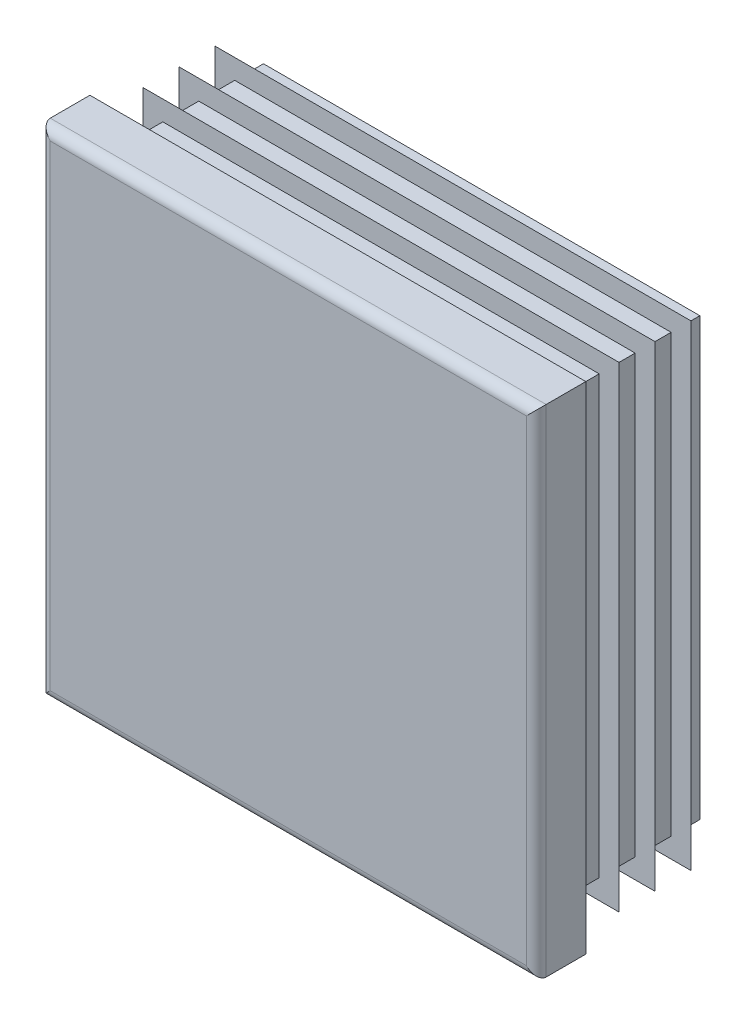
ISO-10303-21;
HEADER;
FILE_DESCRIPTION(('STEP AP214'),'2;1');
FILE_NAME('part.step','',(''),(''),'','','');
FILE_SCHEMA(('AUTOMOTIVE_DESIGN { 1 0 10303 214 1 1 1 1 }'));
ENDSEC;
DATA;
#1=APPLICATION_CONTEXT('core data for automotive mechanical design processes');
#2=APPLICATION_PROTOCOL_DEFINITION('international standard','automotive_design',2000,#1);
#3=PRODUCT_CONTEXT('',#1,'mechanical');
#4=PRODUCT('Part','Part','',(#3));
#5=PRODUCT_RELATED_PRODUCT_CATEGORY('part','',(#4));
#6=PRODUCT_DEFINITION_FORMATION('','',#4);
#7=PRODUCT_DEFINITION_CONTEXT('part definition',#1,'design');
#8=PRODUCT_DEFINITION('design','',#6,#7);
#9=PRODUCT_DEFINITION_SHAPE('','',#8);
#10=(LENGTH_UNIT() NAMED_UNIT(*) SI_UNIT(.MILLI.,.METRE.));
#11=(NAMED_UNIT(*) PLANE_ANGLE_UNIT() SI_UNIT($,.RADIAN.));
#12=(NAMED_UNIT(*) SI_UNIT($,.STERADIAN.) SOLID_ANGLE_UNIT());
#13=UNCERTAINTY_MEASURE_WITH_UNIT(LENGTH_MEASURE(1.E-05),#10,'distance_accuracy_value','');
#14=(GEOMETRIC_REPRESENTATION_CONTEXT(3) GLOBAL_UNCERTAINTY_ASSIGNED_CONTEXT((#13)) GLOBAL_UNIT_ASSIGNED_CONTEXT((#10,
#11,#12)) REPRESENTATION_CONTEXT('',''));
#15=CARTESIAN_POINT('',(0.,0.,0.));
#16=DIRECTION('',(0.,0.,1.));
#17=DIRECTION('',(1.,0.,0.));
#18=AXIS2_PLACEMENT_3D('',#15,#16,#17);
#19=CARTESIAN_POINT('',(24.,-25.,5.));
#20=DIRECTION('',(0.,0.,-1.));
#21=DIRECTION('',(0.,1.,0.));
#22=AXIS2_PLACEMENT_3D('',#19,#20,#21);
#23=PLANE('',#22);
#24=DIRECTION('',(0.,1.,0.));
#25=VECTOR('',#24,1.);
#26=CARTESIAN_POINT('',(-24.,-25.,5.));
#27=LINE('',#26,#25);
#28=CARTESIAN_POINT('',(-24.,-24.,5.));
#29=VERTEX_POINT('',#28);
#30=CARTESIAN_POINT('',(-24.,24.,5.));
#31=VERTEX_POINT('',#30);
#32=EDGE_CURVE('E262',#29,#31,#27,.T.);
#33=ORIENTED_EDGE('',*,*,#32,.F.);
#34=DIRECTION('',(-1.,0.,0.));
#35=VECTOR('',#34,1.);
#36=CARTESIAN_POINT('',(25.,-24.,5.));
#37=LINE('',#36,#35);
#38=CARTESIAN_POINT('',(24.,-24.,5.));
#39=VERTEX_POINT('',#38);
#40=EDGE_CURVE('E432',#39,#29,#37,.T.);
#41=ORIENTED_EDGE('',*,*,#40,.F.);
#42=DIRECTION('',(0.,1.,0.));
#43=VECTOR('',#42,1.);
#44=CARTESIAN_POINT('',(24.,-25.,5.));
#45=LINE('',#44,#43);
#46=CARTESIAN_POINT('',(24.,24.,5.));
#47=VERTEX_POINT('',#46);
#48=EDGE_CURVE('E257',#39,#47,#45,.T.);
#49=ORIENTED_EDGE('',*,*,#48,.T.);
#50=DIRECTION('',(-1.,0.,0.));
#51=VECTOR('',#50,1.);
#52=CARTESIAN_POINT('',(25.,24.,5.));
#53=LINE('',#52,#51);
#54=EDGE_CURVE('E534',#47,#31,#53,.T.);
#55=ORIENTED_EDGE('',*,*,#54,.T.);
#56=EDGE_LOOP('',(#33,#41,#49,#55));
#57=FACE_BOUND('',#56,.T.);
#58=ADVANCED_FACE('F14',(#57),#23,.F.);
#59=CARTESIAN_POINT('',(-24.,-25.,4.));
#60=DIRECTION('',(0.,1.,0.));
#61=DIRECTION('',(-1.,0.,0.));
#62=AXIS2_PLACEMENT_3D('',#59,#60,#61);
#63=CYLINDRICAL_SURFACE('',#62,1.);
#64=DIRECTION('',(0.,1.,0.));
#65=VECTOR('',#64,1.);
#66=CARTESIAN_POINT('',(-25.,-25.,4.));
#67=LINE('',#66,#65);
#68=CARTESIAN_POINT('',(-25.,-25.,4.));
#69=VERTEX_POINT('',#68);
#70=CARTESIAN_POINT('',(-25.,25.,4.));
#71=VERTEX_POINT('',#70);
#72=EDGE_CURVE('E354',#69,#71,#67,.T.);
#73=ORIENTED_EDGE('',*,*,#72,.F.);
#74=CARTESIAN_POINT('',(-24.,-24.,4.));
#75=DIRECTION('',(-0.707106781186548,0.707106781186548,0.));
#76=DIRECTION('',(0.707106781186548,0.707106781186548,0.));
#77=AXIS2_PLACEMENT_3D('',#74,#75,#76);
#78=ELLIPSE('',#77,1.4142135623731,1.);
#79=EDGE_CURVE('E59',#69,#29,#78,.T.);
#80=ORIENTED_EDGE('',*,*,#79,.T.);
#81=ORIENTED_EDGE('',*,*,#32,.T.);
#82=CARTESIAN_POINT('',(-24.,24.,4.));
#83=DIRECTION('',(0.707106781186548,0.707106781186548,0.));
#84=DIRECTION('',(-0.707106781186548,0.707106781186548,0.));
#85=AXIS2_PLACEMENT_3D('',#82,#83,#84);
#86=ELLIPSE('',#85,1.4142135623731,1.);
#87=EDGE_CURVE('E258',#31,#71,#86,.F.);
#88=ORIENTED_EDGE('',*,*,#87,.T.);
#89=EDGE_LOOP('',(#73,#80,#81,#88));
#90=FACE_BOUND('',#89,.T.);
#91=ADVANCED_FACE('F16',(#90),#63,.T.);
#92=CARTESIAN_POINT('',(-25.,-25.,4.));
#93=DIRECTION('',(1.,0.,0.));
#94=DIRECTION('',(0.,1.,0.));
#95=AXIS2_PLACEMENT_3D('',#92,#93,#94);
#96=PLANE('',#95);
#97=DIRECTION('',(0.,0.,-1.));
#98=VECTOR('',#97,1.);
#99=CARTESIAN_POINT('',(-25.,25.,4.));
#100=LINE('',#99,#98);
#101=CARTESIAN_POINT('',(-25.,25.,0.));
#102=VERTEX_POINT('',#101);
#103=EDGE_CURVE('E519',#71,#102,#100,.T.);
#104=ORIENTED_EDGE('',*,*,#103,.T.);
#105=DIRECTION('',(0.,1.,0.));
#106=VECTOR('',#105,1.);
#107=CARTESIAN_POINT('',(-25.,-25.,0.));
#108=LINE('',#107,#106);
#109=CARTESIAN_POINT('',(-25.,-25.,0.));
#110=VERTEX_POINT('',#109);
#111=EDGE_CURVE('E352',#110,#102,#108,.T.);
#112=ORIENTED_EDGE('',*,*,#111,.F.);
#113=DIRECTION('',(0.,0.,-1.));
#114=VECTOR('',#113,1.);
#115=CARTESIAN_POINT('',(-25.,-25.,4.));
#116=LINE('',#115,#114);
#117=EDGE_CURVE('E520',#69,#110,#116,.T.);
#118=ORIENTED_EDGE('',*,*,#117,.F.);
#119=ORIENTED_EDGE('',*,*,#72,.T.);
#120=EDGE_LOOP('',(#104,#112,#118,#119));
#121=FACE_BOUND('',#120,.T.);
#122=ADVANCED_FACE('F604',(#121),#96,.F.);
#123=CARTESIAN_POINT('',(-22.,-25.,0.));
#124=DIRECTION('',(1.,0.,0.));
#125=DIRECTION('',(0.,1.,0.));
#126=AXIS2_PLACEMENT_3D('',#123,#124,#125);
#127=PLANE('',#126);
#128=DIRECTION('',(0.,1.,0.));
#129=VECTOR('',#128,1.);
#130=CARTESIAN_POINT('',(-22.,-25.,0.));
#131=LINE('',#130,#129);
#132=CARTESIAN_POINT('',(-22.,-22.,0.));
#133=VERTEX_POINT('',#132);
#134=CARTESIAN_POINT('',(-22.,22.,0.));
#135=VERTEX_POINT('',#134);
#136=EDGE_CURVE('E349',#133,#135,#131,.T.);
#137=ORIENTED_EDGE('',*,*,#136,.T.);
#138=DIRECTION('',(0.,0.,-1.));
#139=VECTOR('',#138,1.);
#140=CARTESIAN_POINT('',(-22.,22.,0.));
#141=LINE('',#140,#139);
#142=CARTESIAN_POINT('',(-22.,22.,-0.725));
#143=VERTEX_POINT('',#142);
#144=EDGE_CURVE('E445',#135,#143,#141,.T.);
#145=ORIENTED_EDGE('',*,*,#144,.T.);
#146=DIRECTION('',(0.,1.,0.));
#147=VECTOR('',#146,1.);
#148=CARTESIAN_POINT('',(-22.,-25.,-0.725));
#149=LINE('',#148,#147);
#150=CARTESIAN_POINT('',(-22.,-22.,-0.725));
#151=VERTEX_POINT('',#150);
#152=EDGE_CURVE('E346',#151,#143,#149,.T.);
#153=ORIENTED_EDGE('',*,*,#152,.F.);
#154=DIRECTION('',(0.,0.,1.));
#155=VECTOR('',#154,1.);
#156=CARTESIAN_POINT('',(-22.,-22.,0.));
#157=LINE('',#156,#155);
#158=EDGE_CURVE('E439',#151,#133,#157,.T.);
#159=ORIENTED_EDGE('',*,*,#158,.T.);
#160=EDGE_LOOP('',(#137,#145,#153,#159));
#161=FACE_BOUND('',#160,.T.);
#162=ADVANCED_FACE('F728',(#161),#127,.F.);
#163=CARTESIAN_POINT('',(-24.,-25.,-0.725));
#164=DIRECTION('',(0.573576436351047,0.,0.819152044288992));
#165=DIRECTION('',(-0.819152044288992,0.,0.573576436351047));
#166=AXIS2_PLACEMENT_3D('',#163,#164,#165);
#167=PLANE('',#166);
#168=DIRECTION('',(0.,1.,0.));
#169=VECTOR('',#168,1.);
#170=CARTESIAN_POINT('',(-24.,-25.,-0.725));
#171=LINE('',#170,#169);
#172=CARTESIAN_POINT('',(-24.,-24.,-0.725));
#173=VERTEX_POINT('',#172);
#174=CARTESIAN_POINT('',(-24.,24.,-0.725));
#175=VERTEX_POINT('',#174);
#176=EDGE_CURVE('E344',#173,#175,#171,.T.);
#177=ORIENTED_EDGE('',*,*,#176,.T.);
#178=DIRECTION('',(0.633687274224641,-0.633687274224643,-0.443712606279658));
#179=VECTOR('',#178,1.);
#180=CARTESIAN_POINT('',(-4.32358148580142,4.32358148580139,-14.502576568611));
#181=LINE('',#180,#179);
#182=CARTESIAN_POINT('',(-22.,22.,-2.12541507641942));
#183=VERTEX_POINT('',#182);
#184=EDGE_CURVE('E457',#175,#183,#181,.T.);
#185=ORIENTED_EDGE('',*,*,#184,.T.);
#186=DIRECTION('',(0.,1.,0.));
#187=VECTOR('',#186,1.);
#188=CARTESIAN_POINT('',(-22.,-25.,-2.12541507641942));
#189=LINE('',#188,#187);
#190=CARTESIAN_POINT('',(-22.,-22.,-2.12541507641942));
#191=VERTEX_POINT('',#190);
#192=EDGE_CURVE('E341',#191,#183,#189,.T.);
#193=ORIENTED_EDGE('',*,*,#192,.F.);
#194=DIRECTION('',(-0.633687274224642,-0.633687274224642,0.443712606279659));
#195=VECTOR('',#194,1.);
#196=CARTESIAN_POINT('',(-24.4015595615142,-24.4015595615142,-0.443824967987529));
#197=LINE('',#196,#195);
#198=EDGE_CURVE('E451',#191,#173,#197,.T.);
#199=ORIENTED_EDGE('',*,*,#198,.T.);
#200=EDGE_LOOP('',(#177,#185,#193,#199));
#201=FACE_BOUND('',#200,.T.);
#202=ADVANCED_FACE('F732',(#201),#167,.F.);
#203=CARTESIAN_POINT('',(-22.,-25.,-2.12541507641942));
#204=DIRECTION('',(1.,0.,0.));
#205=DIRECTION('',(0.,1.,0.));
#206=AXIS2_PLACEMENT_3D('',#203,#204,#205);
#207=PLANE('',#206);
#208=ORIENTED_EDGE('',*,*,#192,.T.);
#209=DIRECTION('',(0.,0.,-1.));
#210=VECTOR('',#209,1.);
#211=CARTESIAN_POINT('',(-22.,22.,-2.12541507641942));
#212=LINE('',#211,#210);
#213=CARTESIAN_POINT('',(-22.,22.,-4.35));
#214=VERTEX_POINT('',#213);
#215=EDGE_CURVE('E463',#183,#214,#212,.T.);
#216=ORIENTED_EDGE('',*,*,#215,.T.);
#217=DIRECTION('',(0.,1.,0.));
#218=VECTOR('',#217,1.);
#219=CARTESIAN_POINT('',(-22.,-25.,-4.35));
#220=LINE('',#219,#218);
#221=CARTESIAN_POINT('',(-22.,-22.,-4.35));
#222=VERTEX_POINT('',#221);
#223=EDGE_CURVE('E338',#222,#214,#220,.T.);
#224=ORIENTED_EDGE('',*,*,#223,.F.);
#225=DIRECTION('',(0.,0.,1.));
#226=VECTOR('',#225,1.);
#227=CARTESIAN_POINT('',(-22.,-22.,-2.12541507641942));
#228=LINE('',#227,#226);
#229=EDGE_CURVE('E460',#222,#191,#228,.T.);
#230=ORIENTED_EDGE('',*,*,#229,.T.);
#231=EDGE_LOOP('',(#208,#216,#224,#230));
#232=FACE_BOUND('',#231,.T.);
#233=ADVANCED_FACE('F738',(#232),#207,.F.);
#234=CARTESIAN_POINT('',(-24.,-25.,-4.35));
#235=DIRECTION('',(0.573576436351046,0.,0.819152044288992));
#236=DIRECTION('',(-0.819152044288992,0.,0.573576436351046));
#237=AXIS2_PLACEMENT_3D('',#234,#235,#236);
#238=PLANE('',#237);
#239=DIRECTION('',(0.,1.,0.));
#240=VECTOR('',#239,1.);
#241=CARTESIAN_POINT('',(-24.,-25.,-4.35));
#242=LINE('',#241,#240);
#243=CARTESIAN_POINT('',(-24.,-24.,-4.35));
#244=VERTEX_POINT('',#243);
#245=CARTESIAN_POINT('',(-24.,24.,-4.35));
#246=VERTEX_POINT('',#245);
#247=EDGE_CURVE('E336',#244,#246,#242,.T.);
#248=ORIENTED_EDGE('',*,*,#247,.T.);
#249=DIRECTION('',(0.633687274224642,-0.633687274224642,-0.443712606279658));
#250=VECTOR('',#249,1.);
#251=CARTESIAN_POINT('',(-4.32358148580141,4.32358148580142,-18.1275765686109));
#252=LINE('',#251,#250);
#253=CARTESIAN_POINT('',(-22.,22.,-5.75041507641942));
#254=VERTEX_POINT('',#253);
#255=EDGE_CURVE('E475',#246,#254,#252,.T.);
#256=ORIENTED_EDGE('',*,*,#255,.T.);
#257=DIRECTION('',(0.,1.,0.));
#258=VECTOR('',#257,1.);
#259=CARTESIAN_POINT('',(-22.,-25.,-5.75041507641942));
#260=LINE('',#259,#258);
#261=CARTESIAN_POINT('',(-22.,-22.,-5.75041507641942));
#262=VERTEX_POINT('',#261);
#263=EDGE_CURVE('E333',#262,#254,#260,.T.);
#264=ORIENTED_EDGE('',*,*,#263,.F.);
#265=DIRECTION('',(-0.633687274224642,-0.633687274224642,0.443712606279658));
#266=VECTOR('',#265,1.);
#267=CARTESIAN_POINT('',(-24.4015595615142,-24.4015595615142,-4.06882496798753));
#268=LINE('',#267,#266);
#269=EDGE_CURVE('E469',#262,#244,#268,.T.);
#270=ORIENTED_EDGE('',*,*,#269,.T.);
#271=EDGE_LOOP('',(#248,#256,#264,#270));
#272=FACE_BOUND('',#271,.T.);
#273=ADVANCED_FACE('F742',(#272),#238,.F.);
#274=CARTESIAN_POINT('',(-22.,-25.,-5.75041507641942));
#275=DIRECTION('',(1.,0.,0.));
#276=DIRECTION('',(0.,1.,0.));
#277=AXIS2_PLACEMENT_3D('',#274,#275,#276);
#278=PLANE('',#277);
#279=ORIENTED_EDGE('',*,*,#263,.T.);
#280=DIRECTION('',(0.,0.,-1.));
#281=VECTOR('',#280,1.);
#282=CARTESIAN_POINT('',(-22.,22.,-5.75041507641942));
#283=LINE('',#282,#281);
#284=CARTESIAN_POINT('',(-22.,22.,-7.975));
#285=VERTEX_POINT('',#284);
#286=EDGE_CURVE('E481',#254,#285,#283,.T.);
#287=ORIENTED_EDGE('',*,*,#286,.T.);
#288=DIRECTION('',(0.,1.,0.));
#289=VECTOR('',#288,1.);
#290=CARTESIAN_POINT('',(-22.,-25.,-7.975));
#291=LINE('',#290,#289);
#292=CARTESIAN_POINT('',(-22.,-22.,-7.975));
#293=VERTEX_POINT('',#292);
#294=EDGE_CURVE('E330',#293,#285,#291,.T.);
#295=ORIENTED_EDGE('',*,*,#294,.F.);
#296=DIRECTION('',(0.,0.,1.));
#297=VECTOR('',#296,1.);
#298=CARTESIAN_POINT('',(-22.,-22.,-5.75041507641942));
#299=LINE('',#298,#297);
#300=EDGE_CURVE('E478',#293,#262,#299,.T.);
#301=ORIENTED_EDGE('',*,*,#300,.T.);
#302=EDGE_LOOP('',(#279,#287,#295,#301));
#303=FACE_BOUND('',#302,.T.);
#304=ADVANCED_FACE('F746',(#303),#278,.F.);
#305=CARTESIAN_POINT('',(-24.,-25.,-7.975));
#306=DIRECTION('',(0.573576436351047,0.,0.819152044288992));
#307=DIRECTION('',(-0.819152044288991,0.,0.573576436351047));
#308=AXIS2_PLACEMENT_3D('',#305,#306,#307);
#309=PLANE('',#308);
#310=DIRECTION('',(0.,1.,0.));
#311=VECTOR('',#310,1.);
#312=CARTESIAN_POINT('',(-24.,-25.,-7.975));
#313=LINE('',#312,#311);
#314=CARTESIAN_POINT('',(-24.,-24.,-7.975));
#315=VERTEX_POINT('',#314);
#316=CARTESIAN_POINT('',(-24.,24.,-7.975));
#317=VERTEX_POINT('',#316);
#318=EDGE_CURVE('E328',#315,#317,#313,.T.);
#319=ORIENTED_EDGE('',*,*,#318,.T.);
#320=DIRECTION('',(0.633687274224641,-0.633687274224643,-0.443712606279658));
#321=VECTOR('',#320,1.);
#322=CARTESIAN_POINT('',(-4.32358148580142,4.32358148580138,-21.7525765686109));
#323=LINE('',#322,#321);
#324=CARTESIAN_POINT('',(-22.,22.,-9.37541507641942));
#325=VERTEX_POINT('',#324);
#326=EDGE_CURVE('E493',#317,#325,#323,.T.);
#327=ORIENTED_EDGE('',*,*,#326,.T.);
#328=DIRECTION('',(0.,1.,0.));
#329=VECTOR('',#328,1.);
#330=CARTESIAN_POINT('',(-22.,-25.,-9.37541507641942));
#331=LINE('',#330,#329);
#332=CARTESIAN_POINT('',(-22.,-22.,-9.37541507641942));
#333=VERTEX_POINT('',#332);
#334=EDGE_CURVE('E325',#333,#325,#331,.T.);
#335=ORIENTED_EDGE('',*,*,#334,.F.);
#336=DIRECTION('',(-0.633687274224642,-0.633687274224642,0.443712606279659));
#337=VECTOR('',#336,1.);
#338=CARTESIAN_POINT('',(-24.4015595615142,-24.4015595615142,-7.69382496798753));
#339=LINE('',#338,#337);
#340=EDGE_CURVE('E487',#333,#315,#339,.T.);
#341=ORIENTED_EDGE('',*,*,#340,.T.);
#342=EDGE_LOOP('',(#319,#327,#335,#341));
#343=FACE_BOUND('',#342,.T.);
#344=ADVANCED_FACE('F668',(#343),#309,.F.);
#345=CARTESIAN_POINT('',(-22.,-25.,-9.37541507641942));
#346=DIRECTION('',(1.,0.,0.));
#347=DIRECTION('',(0.,1.,0.));
#348=AXIS2_PLACEMENT_3D('',#345,#346,#347);
#349=PLANE('',#348);
#350=ORIENTED_EDGE('',*,*,#334,.T.);
#351=DIRECTION('',(0.,0.,-1.));
#352=VECTOR('',#351,1.);
#353=CARTESIAN_POINT('',(-22.,22.,-9.37541507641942));
#354=LINE('',#353,#352);
#355=CARTESIAN_POINT('',(-22.,22.,-11.6));
#356=VERTEX_POINT('',#355);
#357=EDGE_CURVE('E499',#325,#356,#354,.T.);
#358=ORIENTED_EDGE('',*,*,#357,.T.);
#359=DIRECTION('',(0.,1.,0.));
#360=VECTOR('',#359,1.);
#361=CARTESIAN_POINT('',(-22.,-25.,-11.6));
#362=LINE('',#361,#360);
#363=CARTESIAN_POINT('',(-22.,-22.,-11.6));
#364=VERTEX_POINT('',#363);
#365=EDGE_CURVE('E322',#364,#356,#362,.T.);
#366=ORIENTED_EDGE('',*,*,#365,.F.);
#367=DIRECTION('',(0.,0.,1.));
#368=VECTOR('',#367,1.);
#369=CARTESIAN_POINT('',(-22.,-22.,-9.37541507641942));
#370=LINE('',#369,#368);
#371=EDGE_CURVE('E496',#364,#333,#370,.T.);
#372=ORIENTED_EDGE('',*,*,#371,.T.);
#373=EDGE_LOOP('',(#350,#358,#366,#372));
#374=FACE_BOUND('',#373,.T.);
#375=ADVANCED_FACE('F665',(#374),#349,.F.);
#376=CARTESIAN_POINT('',(-24.,-25.,-11.6));
#377=DIRECTION('',(0.573576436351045,0.,0.819152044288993));
#378=DIRECTION('',(-0.819152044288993,0.,0.573576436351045));
#379=AXIS2_PLACEMENT_3D('',#376,#377,#378);
#380=PLANE('',#379);
#381=DIRECTION('',(0.,1.,0.));
#382=VECTOR('',#381,1.);
#383=CARTESIAN_POINT('',(-24.,-25.,-11.6));
#384=LINE('',#383,#382);
#385=CARTESIAN_POINT('',(-24.,-24.,-11.6));
#386=VERTEX_POINT('',#385);
#387=CARTESIAN_POINT('',(-24.,24.,-11.6));
#388=VERTEX_POINT('',#387);
#389=EDGE_CURVE('E320',#386,#388,#384,.T.);
#390=ORIENTED_EDGE('',*,*,#389,.T.);
#391=DIRECTION('',(0.633687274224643,-0.633687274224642,-0.443712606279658));
#392=VECTOR('',#391,1.);
#393=CARTESIAN_POINT('',(-4.32358148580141,4.32358148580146,-25.3775765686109));
#394=LINE('',#393,#392);
#395=CARTESIAN_POINT('',(-22.,22.,-13.0004150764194));
#396=VERTEX_POINT('',#395);
#397=EDGE_CURVE('E511',#388,#396,#394,.T.);
#398=ORIENTED_EDGE('',*,*,#397,.T.);
#399=DIRECTION('',(0.,1.,0.));
#400=VECTOR('',#399,1.);
#401=CARTESIAN_POINT('',(-22.,-25.,-13.0004150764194));
#402=LINE('',#401,#400);
#403=CARTESIAN_POINT('',(-22.,-22.,-13.0004150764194));
#404=VERTEX_POINT('',#403);
#405=EDGE_CURVE('E317',#404,#396,#402,.T.);
#406=ORIENTED_EDGE('',*,*,#405,.F.);
#407=DIRECTION('',(-0.633687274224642,-0.633687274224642,0.443712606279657));
#408=VECTOR('',#407,1.);
#409=CARTESIAN_POINT('',(-24.4015595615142,-24.4015595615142,-11.3188249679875));
#410=LINE('',#409,#408);
#411=EDGE_CURVE('E505',#404,#386,#410,.T.);
#412=ORIENTED_EDGE('',*,*,#411,.T.);
#413=EDGE_LOOP('',(#390,#398,#406,#412));
#414=FACE_BOUND('',#413,.T.);
#415=ADVANCED_FACE('F580',(#414),#380,.F.);
#416=CARTESIAN_POINT('',(-22.,-25.,-13.0004150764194));
#417=DIRECTION('',(1.,0.,0.));
#418=DIRECTION('',(0.,1.,0.));
#419=AXIS2_PLACEMENT_3D('',#416,#417,#418);
#420=PLANE('',#419);
#421=ORIENTED_EDGE('',*,*,#405,.T.);
#422=DIRECTION('',(0.,0.,-1.));
#423=VECTOR('',#422,1.);
#424=CARTESIAN_POINT('',(-22.,22.,-13.0004150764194));
#425=LINE('',#424,#423);
#426=CARTESIAN_POINT('',(-22.,22.,-14.5));
#427=VERTEX_POINT('',#426);
#428=EDGE_CURVE('E517',#396,#427,#425,.T.);
#429=ORIENTED_EDGE('',*,*,#428,.T.);
#430=DIRECTION('',(0.,1.,0.));
#431=VECTOR('',#430,1.);
#432=CARTESIAN_POINT('',(-22.,-25.,-14.5));
#433=LINE('',#432,#431);
#434=CARTESIAN_POINT('',(-22.,-22.,-14.5));
#435=VERTEX_POINT('',#434);
#436=EDGE_CURVE('E314',#435,#427,#433,.T.);
#437=ORIENTED_EDGE('',*,*,#436,.F.);
#438=DIRECTION('',(0.,0.,1.));
#439=VECTOR('',#438,1.);
#440=CARTESIAN_POINT('',(-22.,-22.,-13.0004150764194));
#441=LINE('',#440,#439);
#442=EDGE_CURVE('E514',#435,#404,#441,.T.);
#443=ORIENTED_EDGE('',*,*,#442,.T.);
#444=EDGE_LOOP('',(#421,#429,#437,#443));
#445=FACE_BOUND('',#444,.T.);
#446=ADVANCED_FACE('F582',(#445),#420,.F.);
#447=CARTESIAN_POINT('',(-22.,-25.,-14.5));
#448=DIRECTION('',(0.,0.,1.));
#449=DIRECTION('',(0.,-1.,0.));
#450=AXIS2_PLACEMENT_3D('',#447,#448,#449);
#451=PLANE('',#450);
#452=ORIENTED_EDGE('',*,*,#436,.T.);
#453=DIRECTION('',(-1.,0.,0.));
#454=VECTOR('',#453,1.);
#455=CARTESIAN_POINT('',(25.,22.,-14.5));
#456=LINE('',#455,#454);
#457=CARTESIAN_POINT('',(22.,22.,-14.5));
#458=VERTEX_POINT('',#457);
#459=EDGE_CURVE('E388',#458,#427,#456,.T.);
#460=ORIENTED_EDGE('',*,*,#459,.F.);
#461=DIRECTION('',(0.,1.,0.));
#462=VECTOR('',#461,1.);
#463=CARTESIAN_POINT('',(22.,-25.,-14.5));
#464=LINE('',#463,#462);
#465=CARTESIAN_POINT('',(22.,-22.,-14.5));
#466=VERTEX_POINT('',#465);
#467=EDGE_CURVE('E311',#466,#458,#464,.T.);
#468=ORIENTED_EDGE('',*,*,#467,.F.);
#469=DIRECTION('',(-1.,0.,0.));
#470=VECTOR('',#469,1.);
#471=CARTESIAN_POINT('',(25.,-22.,-14.5));
#472=LINE('',#471,#470);
#473=EDGE_CURVE('E386',#466,#435,#472,.T.);
#474=ORIENTED_EDGE('',*,*,#473,.T.);
#475=EDGE_LOOP('',(#452,#460,#468,#474));
#476=FACE_BOUND('',#475,.T.);
#477=ADVANCED_FACE('F385',(#476),#451,.F.);
#478=CARTESIAN_POINT('',(22.,-25.,-14.5));
#479=DIRECTION('',(-1.,0.,0.));
#480=DIRECTION('',(0.,-1.,0.));
#481=AXIS2_PLACEMENT_3D('',#478,#479,#480);
#482=PLANE('',#481);
#483=ORIENTED_EDGE('',*,*,#467,.T.);
#484=DIRECTION('',(0.,0.,1.));
#485=VECTOR('',#484,1.);
#486=CARTESIAN_POINT('',(22.,22.,-14.5));
#487=LINE('',#486,#485);
#488=CARTESIAN_POINT('',(22.,22.,-13.0004150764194));
#489=VERTEX_POINT('',#488);
#490=EDGE_CURVE('E9',#458,#489,#487,.T.);
#491=ORIENTED_EDGE('',*,*,#490,.T.);
#492=DIRECTION('',(0.,1.,0.));
#493=VECTOR('',#492,1.);
#494=CARTESIAN_POINT('',(22.,-25.,-13.0004150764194));
#495=LINE('',#494,#493);
#496=CARTESIAN_POINT('',(22.,-22.,-13.0004150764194));
#497=VERTEX_POINT('',#496);
#498=EDGE_CURVE('E308',#497,#489,#495,.T.);
#499=ORIENTED_EDGE('',*,*,#498,.F.);
#500=DIRECTION('',(0.,0.,-1.));
#501=VECTOR('',#500,1.);
#502=CARTESIAN_POINT('',(22.,-22.,-14.5));
#503=LINE('',#502,#501);
#504=EDGE_CURVE('E23',#497,#466,#503,.T.);
#505=ORIENTED_EDGE('',*,*,#504,.T.);
#506=EDGE_LOOP('',(#483,#491,#499,#505));
#507=FACE_BOUND('',#506,.T.);
#508=ADVANCED_FACE('F378',(#507),#482,.F.);
#509=CARTESIAN_POINT('',(22.,-25.,-13.0004150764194));
#510=DIRECTION('',(-0.573576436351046,0.,0.819152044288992));
#511=DIRECTION('',(-0.819152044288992,0.,-0.573576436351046));
#512=AXIS2_PLACEMENT_3D('',#509,#510,#511);
#513=PLANE('',#512);
#514=ORIENTED_EDGE('',*,*,#498,.T.);
#515=DIRECTION('',(0.633687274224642,0.633687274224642,0.443712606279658));
#516=VECTOR('',#515,1.);
#517=CARTESIAN_POINT('',(3.12670060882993,3.12670060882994,-26.2156415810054));
#518=LINE('',#517,#516);
#519=CARTESIAN_POINT('',(24.,24.,-11.6));
#520=VERTEX_POINT('',#519);
#521=EDGE_CURVE('E508',#489,#520,#518,.T.);
#522=ORIENTED_EDGE('',*,*,#521,.T.);
#523=DIRECTION('',(0.,1.,0.));
#524=VECTOR('',#523,1.);
#525=CARTESIAN_POINT('',(24.,-25.,-11.6));
#526=LINE('',#525,#524);
#527=CARTESIAN_POINT('',(24.,-24.,-11.6));
#528=VERTEX_POINT('',#527);
#529=EDGE_CURVE('E305',#528,#520,#526,.T.);
#530=ORIENTED_EDGE('',*,*,#529,.F.);
#531=DIRECTION('',(-0.633687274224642,0.633687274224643,-0.443712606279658));
#532=VECTOR('',#531,1.);
#533=CARTESIAN_POINT('',(23.2046786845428,-23.2046786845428,-12.156889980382));
#534=LINE('',#533,#532);
#535=EDGE_CURVE('E502',#528,#497,#534,.T.);
#536=ORIENTED_EDGE('',*,*,#535,.T.);
#537=EDGE_LOOP('',(#514,#522,#530,#536));
#538=FACE_BOUND('',#537,.T.);
#539=ADVANCED_FACE('F588',(#538),#513,.F.);
#540=CARTESIAN_POINT('',(24.,-25.,-11.6));
#541=DIRECTION('',(0.,0.,-1.));
#542=DIRECTION('',(0.,1.,0.));
#543=AXIS2_PLACEMENT_3D('',#540,#541,#542);
#544=PLANE('',#543);
#545=ORIENTED_EDGE('',*,*,#529,.T.);
#546=DIRECTION('',(-1.,0.,0.));
#547=VECTOR('',#546,1.);
#548=CARTESIAN_POINT('',(25.,24.,-11.6));
#549=LINE('',#548,#547);
#550=EDGE_CURVE('E394',#520,#388,#549,.T.);
#551=ORIENTED_EDGE('',*,*,#550,.T.);
#552=ORIENTED_EDGE('',*,*,#389,.F.);
#553=DIRECTION('',(-1.,0.,0.));
#554=VECTOR('',#553,1.);
#555=CARTESIAN_POINT('',(25.,-24.,-11.6));
#556=LINE('',#555,#554);
#557=EDGE_CURVE('E401',#528,#386,#556,.T.);
#558=ORIENTED_EDGE('',*,*,#557,.F.);
#559=EDGE_LOOP('',(#545,#551,#552,#558));
#560=FACE_BOUND('',#559,.T.);
#561=ORIENTED_EDGE('',*,*,#365,.T.);
#562=DIRECTION('',(-1.,0.,0.));
#563=VECTOR('',#562,1.);
#564=CARTESIAN_POINT('',(25.,22.,-11.6));
#565=LINE('',#564,#563);
#566=CARTESIAN_POINT('',(22.,22.,-11.6));
#567=VERTEX_POINT('',#566);
#568=EDGE_CURVE('E567',#567,#356,#565,.T.);
#569=ORIENTED_EDGE('',*,*,#568,.F.);
#570=DIRECTION('',(0.,1.,0.));
#571=VECTOR('',#570,1.);
#572=CARTESIAN_POINT('',(22.,-25.,-11.6));
#573=LINE('',#572,#571);
#574=CARTESIAN_POINT('',(22.,-22.,-11.6));
#575=VERTEX_POINT('',#574);
#576=EDGE_CURVE('E302',#575,#567,#573,.T.);
#577=ORIENTED_EDGE('',*,*,#576,.F.);
#578=DIRECTION('',(-1.,0.,0.));
#579=VECTOR('',#578,1.);
#580=CARTESIAN_POINT('',(25.,-22.,-11.6));
#581=LINE('',#580,#579);
#582=EDGE_CURVE('E403',#575,#364,#581,.T.);
#583=ORIENTED_EDGE('',*,*,#582,.T.);
#584=EDGE_LOOP('',(#561,#569,#577,#583));
#585=FACE_BOUND('',#584,.T.);
#586=ADVANCED_FACE('F571',(#560,#585),#544,.F.);
#587=CARTESIAN_POINT('',(22.,-25.,-11.6));
#588=DIRECTION('',(-1.,0.,0.));
#589=DIRECTION('',(0.,-1.,0.));
#590=AXIS2_PLACEMENT_3D('',#587,#588,#589);
#591=PLANE('',#590);
#592=ORIENTED_EDGE('',*,*,#576,.T.);
#593=DIRECTION('',(0.,0.,1.));
#594=VECTOR('',#593,1.);
#595=CARTESIAN_POINT('',(22.,22.,-11.6));
#596=LINE('',#595,#594);
#597=CARTESIAN_POINT('',(22.,22.,-9.37541507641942));
#598=VERTEX_POINT('',#597);
#599=EDGE_CURVE('E372',#567,#598,#596,.T.);
#600=ORIENTED_EDGE('',*,*,#599,.T.);
#601=DIRECTION('',(0.,1.,0.));
#602=VECTOR('',#601,1.);
#603=CARTESIAN_POINT('',(22.,-25.,-9.37541507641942));
#604=LINE('',#603,#602);
#605=CARTESIAN_POINT('',(22.,-22.,-9.37541507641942));
#606=VERTEX_POINT('',#605);
#607=EDGE_CURVE('E299',#606,#598,#604,.T.);
#608=ORIENTED_EDGE('',*,*,#607,.F.);
#609=DIRECTION('',(0.,0.,-1.));
#610=VECTOR('',#609,1.);
#611=CARTESIAN_POINT('',(22.,-22.,-11.6));
#612=LINE('',#611,#610);
#613=EDGE_CURVE('E369',#606,#575,#612,.T.);
#614=ORIENTED_EDGE('',*,*,#613,.T.);
#615=EDGE_LOOP('',(#592,#600,#608,#614));
#616=FACE_BOUND('',#615,.T.);
#617=ADVANCED_FACE('F596',(#616),#591,.F.);
#618=CARTESIAN_POINT('',(22.,-25.,-9.37541507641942));
#619=DIRECTION('',(-0.573576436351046,0.,0.819152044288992));
#620=DIRECTION('',(-0.819152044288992,0.,-0.573576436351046));
#621=AXIS2_PLACEMENT_3D('',#618,#619,#620);
#622=PLANE('',#621);
#623=ORIENTED_EDGE('',*,*,#607,.T.);
#624=DIRECTION('',(0.633687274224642,0.633687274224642,0.443712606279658));
#625=VECTOR('',#624,1.);
#626=CARTESIAN_POINT('',(3.12670060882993,3.12670060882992,-22.5906415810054));
#627=LINE('',#626,#625);
#628=CARTESIAN_POINT('',(24.,24.,-7.975));
#629=VERTEX_POINT('',#628);
#630=EDGE_CURVE('E490',#598,#629,#627,.T.);
#631=ORIENTED_EDGE('',*,*,#630,.T.);
#632=DIRECTION('',(0.,1.,0.));
#633=VECTOR('',#632,1.);
#634=CARTESIAN_POINT('',(24.,-25.,-7.975));
#635=LINE('',#634,#633);
#636=CARTESIAN_POINT('',(24.,-24.,-7.975));
#637=VERTEX_POINT('',#636);
#638=EDGE_CURVE('E296',#637,#629,#635,.T.);
#639=ORIENTED_EDGE('',*,*,#638,.F.);
#640=DIRECTION('',(-0.633687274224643,0.633687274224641,-0.443712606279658));
#641=VECTOR('',#640,1.);
#642=CARTESIAN_POINT('',(23.2046786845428,-23.2046786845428,-8.53188998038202));
#643=LINE('',#642,#641);
#644=EDGE_CURVE('E484',#637,#606,#643,.T.);
#645=ORIENTED_EDGE('',*,*,#644,.T.);
#646=EDGE_LOOP('',(#623,#631,#639,#645));
#647=FACE_BOUND('',#646,.T.);
#648=ADVANCED_FACE('F648',(#647),#622,.F.);
#649=CARTESIAN_POINT('',(24.,-25.,-7.975));
#650=DIRECTION('',(0.,0.,-1.));
#651=DIRECTION('',(0.,1.,0.));
#652=AXIS2_PLACEMENT_3D('',#649,#650,#651);
#653=PLANE('',#652);
#654=ORIENTED_EDGE('',*,*,#638,.T.);
#655=DIRECTION('',(-1.,0.,0.));
#656=VECTOR('',#655,1.);
#657=CARTESIAN_POINT('',(25.,24.,-7.975));
#658=LINE('',#657,#656);
#659=EDGE_CURVE('E561',#629,#317,#658,.T.);
#660=ORIENTED_EDGE('',*,*,#659,.T.);
#661=ORIENTED_EDGE('',*,*,#318,.F.);
#662=DIRECTION('',(-1.,0.,0.));
#663=VECTOR('',#662,1.);
#664=CARTESIAN_POINT('',(25.,-24.,-7.975));
#665=LINE('',#664,#663);
#666=EDGE_CURVE('E409',#637,#315,#665,.T.);
#667=ORIENTED_EDGE('',*,*,#666,.F.);
#668=EDGE_LOOP('',(#654,#660,#661,#667));
#669=FACE_BOUND('',#668,.T.);
#670=ORIENTED_EDGE('',*,*,#294,.T.);
#671=DIRECTION('',(-1.,0.,0.));
#672=VECTOR('',#671,1.);
#673=CARTESIAN_POINT('',(25.,22.,-7.975));
#674=LINE('',#673,#672);
#675=CARTESIAN_POINT('',(22.,22.,-7.975));
#676=VERTEX_POINT('',#675);
#677=EDGE_CURVE('E559',#676,#285,#674,.T.);
#678=ORIENTED_EDGE('',*,*,#677,.F.);
#679=DIRECTION('',(0.,1.,0.));
#680=VECTOR('',#679,1.);
#681=CARTESIAN_POINT('',(22.,-25.,-7.975));
#682=LINE('',#681,#680);
#683=CARTESIAN_POINT('',(22.,-22.,-7.975));
#684=VERTEX_POINT('',#683);
#685=EDGE_CURVE('E293',#684,#676,#682,.T.);
#686=ORIENTED_EDGE('',*,*,#685,.F.);
#687=DIRECTION('',(-1.,0.,0.));
#688=VECTOR('',#687,1.);
#689=CARTESIAN_POINT('',(25.,-22.,-7.975));
#690=LINE('',#689,#688);
#691=EDGE_CURVE('E411',#684,#293,#690,.T.);
#692=ORIENTED_EDGE('',*,*,#691,.T.);
#693=EDGE_LOOP('',(#670,#678,#686,#692));
#694=FACE_BOUND('',#693,.T.);
#695=ADVANCED_FACE('F644',(#669,#694),#653,.F.);
#696=CARTESIAN_POINT('',(22.,-25.,-7.975));
#697=DIRECTION('',(-1.,0.,0.));
#698=DIRECTION('',(0.,-1.,0.));
#699=AXIS2_PLACEMENT_3D('',#696,#697,#698);
#700=PLANE('',#699);
#701=ORIENTED_EDGE('',*,*,#685,.T.);
#702=DIRECTION('',(0.,0.,1.));
#703=VECTOR('',#702,1.);
#704=CARTESIAN_POINT('',(22.,22.,-7.975));
#705=LINE('',#704,#703);
#706=CARTESIAN_POINT('',(22.,22.,-5.75041507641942));
#707=VERTEX_POINT('',#706);
#708=EDGE_CURVE('E366',#676,#707,#705,.T.);
#709=ORIENTED_EDGE('',*,*,#708,.T.);
#710=DIRECTION('',(0.,1.,0.));
#711=VECTOR('',#710,1.);
#712=CARTESIAN_POINT('',(22.,-25.,-5.75041507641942));
#713=LINE('',#712,#711);
#714=CARTESIAN_POINT('',(22.,-22.,-5.75041507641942));
#715=VERTEX_POINT('',#714);
#716=EDGE_CURVE('E290',#715,#707,#713,.T.);
#717=ORIENTED_EDGE('',*,*,#716,.F.);
#718=DIRECTION('',(0.,0.,-1.));
#719=VECTOR('',#718,1.);
#720=CARTESIAN_POINT('',(22.,-22.,-7.975));
#721=LINE('',#720,#719);
#722=EDGE_CURVE('E363',#715,#684,#721,.T.);
#723=ORIENTED_EDGE('',*,*,#722,.T.);
#724=EDGE_LOOP('',(#701,#709,#717,#723));
#725=FACE_BOUND('',#724,.T.);
#726=ADVANCED_FACE('F640',(#725),#700,.F.);
#727=CARTESIAN_POINT('',(22.,-25.,-5.75041507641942));
#728=DIRECTION('',(-0.573576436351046,0.,0.819152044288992));
#729=DIRECTION('',(-0.819152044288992,0.,-0.573576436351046));
#730=AXIS2_PLACEMENT_3D('',#727,#728,#729);
#731=PLANE('',#730);
#732=ORIENTED_EDGE('',*,*,#716,.T.);
#733=DIRECTION('',(0.633687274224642,0.633687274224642,0.443712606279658));
#734=VECTOR('',#733,1.);
#735=CARTESIAN_POINT('',(3.12670060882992,3.12670060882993,-18.9656415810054));
#736=LINE('',#735,#734);
#737=CARTESIAN_POINT('',(24.,24.,-4.35));
#738=VERTEX_POINT('',#737);
#739=EDGE_CURVE('E472',#707,#738,#736,.T.);
#740=ORIENTED_EDGE('',*,*,#739,.T.);
#741=DIRECTION('',(0.,1.,0.));
#742=VECTOR('',#741,1.);
#743=CARTESIAN_POINT('',(24.,-25.,-4.35));
#744=LINE('',#743,#742);
#745=CARTESIAN_POINT('',(24.,-24.,-4.35));
#746=VERTEX_POINT('',#745);
#747=EDGE_CURVE('E287',#746,#738,#744,.T.);
#748=ORIENTED_EDGE('',*,*,#747,.F.);
#749=DIRECTION('',(-0.633687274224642,0.633687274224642,-0.443712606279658));
#750=VECTOR('',#749,1.);
#751=CARTESIAN_POINT('',(23.2046786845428,-23.2046786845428,-4.90688998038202));
#752=LINE('',#751,#750);
#753=EDGE_CURVE('E466',#746,#715,#752,.T.);
#754=ORIENTED_EDGE('',*,*,#753,.T.);
#755=EDGE_LOOP('',(#732,#740,#748,#754));
#756=FACE_BOUND('',#755,.T.);
#757=ADVANCED_FACE('F636',(#756),#731,.F.);
#758=CARTESIAN_POINT('',(24.,-25.,-4.35));
#759=DIRECTION('',(0.,0.,-1.));
#760=DIRECTION('',(0.,1.,0.));
#761=AXIS2_PLACEMENT_3D('',#758,#759,#760);
#762=PLANE('',#761);
#763=ORIENTED_EDGE('',*,*,#747,.T.);
#764=DIRECTION('',(-1.,0.,0.));
#765=VECTOR('',#764,1.);
#766=CARTESIAN_POINT('',(25.,24.,-4.35));
#767=LINE('',#766,#765);
#768=EDGE_CURVE('E553',#738,#246,#767,.T.);
#769=ORIENTED_EDGE('',*,*,#768,.T.);
#770=ORIENTED_EDGE('',*,*,#247,.F.);
#771=DIRECTION('',(-1.,0.,0.));
#772=VECTOR('',#771,1.);
#773=CARTESIAN_POINT('',(25.,-24.,-4.35));
#774=LINE('',#773,#772);
#775=EDGE_CURVE('E417',#746,#244,#774,.T.);
#776=ORIENTED_EDGE('',*,*,#775,.F.);
#777=EDGE_LOOP('',(#763,#769,#770,#776));
#778=FACE_BOUND('',#777,.T.);
#779=ORIENTED_EDGE('',*,*,#223,.T.);
#780=DIRECTION('',(-1.,0.,0.));
#781=VECTOR('',#780,1.);
#782=CARTESIAN_POINT('',(25.,22.,-4.35));
#783=LINE('',#782,#781);
#784=CARTESIAN_POINT('',(22.,22.,-4.35));
#785=VERTEX_POINT('',#784);
#786=EDGE_CURVE('E551',#785,#214,#783,.T.);
#787=ORIENTED_EDGE('',*,*,#786,.F.);
#788=DIRECTION('',(0.,1.,0.));
#789=VECTOR('',#788,1.);
#790=CARTESIAN_POINT('',(22.,-25.,-4.35));
#791=LINE('',#790,#789);
#792=CARTESIAN_POINT('',(22.,-22.,-4.35));
#793=VERTEX_POINT('',#792);
#794=EDGE_CURVE('E284',#793,#785,#791,.T.);
#795=ORIENTED_EDGE('',*,*,#794,.F.);
#796=DIRECTION('',(-1.,0.,0.));
#797=VECTOR('',#796,1.);
#798=CARTESIAN_POINT('',(25.,-22.,-4.35));
#799=LINE('',#798,#797);
#800=EDGE_CURVE('E419',#793,#222,#799,.T.);
#801=ORIENTED_EDGE('',*,*,#800,.T.);
#802=EDGE_LOOP('',(#779,#787,#795,#801));
#803=FACE_BOUND('',#802,.T.);
#804=ADVANCED_FACE('F632',(#778,#803),#762,.F.);
#805=CARTESIAN_POINT('',(22.,-25.,-4.35));
#806=DIRECTION('',(-1.,0.,0.));
#807=DIRECTION('',(0.,-1.,0.));
#808=AXIS2_PLACEMENT_3D('',#805,#806,#807);
#809=PLANE('',#808);
#810=ORIENTED_EDGE('',*,*,#794,.T.);
#811=DIRECTION('',(0.,0.,1.));
#812=VECTOR('',#811,1.);
#813=CARTESIAN_POINT('',(22.,22.,-4.35));
#814=LINE('',#813,#812);
#815=CARTESIAN_POINT('',(22.,22.,-2.12541507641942));
#816=VERTEX_POINT('',#815);
#817=EDGE_CURVE('E360',#785,#816,#814,.T.);
#818=ORIENTED_EDGE('',*,*,#817,.T.);
#819=DIRECTION('',(0.,1.,0.));
#820=VECTOR('',#819,1.);
#821=CARTESIAN_POINT('',(22.,-25.,-2.12541507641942));
#822=LINE('',#821,#820);
#823=CARTESIAN_POINT('',(22.,-22.,-2.12541507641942));
#824=VERTEX_POINT('',#823);
#825=EDGE_CURVE('E281',#824,#816,#822,.T.);
#826=ORIENTED_EDGE('',*,*,#825,.F.);
#827=DIRECTION('',(0.,0.,-1.));
#828=VECTOR('',#827,1.);
#829=CARTESIAN_POINT('',(22.,-22.,-4.35));
#830=LINE('',#829,#828);
#831=EDGE_CURVE('E357',#824,#793,#830,.T.);
#832=ORIENTED_EDGE('',*,*,#831,.T.);
#833=EDGE_LOOP('',(#810,#818,#826,#832));
#834=FACE_BOUND('',#833,.T.);
#835=ADVANCED_FACE('F628',(#834),#809,.F.);
#836=CARTESIAN_POINT('',(22.,-25.,-2.12541507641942));
#837=DIRECTION('',(-0.573576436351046,0.,0.819152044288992));
#838=DIRECTION('',(-0.819152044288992,0.,-0.573576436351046));
#839=AXIS2_PLACEMENT_3D('',#836,#837,#838);
#840=PLANE('',#839);
#841=ORIENTED_EDGE('',*,*,#825,.T.);
#842=DIRECTION('',(0.633687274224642,0.633687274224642,0.443712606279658));
#843=VECTOR('',#842,1.);
#844=CARTESIAN_POINT('',(3.12670060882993,3.12670060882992,-15.3406415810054));
#845=LINE('',#844,#843);
#846=CARTESIAN_POINT('',(24.,24.,-0.725));
#847=VERTEX_POINT('',#846);
#848=EDGE_CURVE('E454',#816,#847,#845,.T.);
#849=ORIENTED_EDGE('',*,*,#848,.T.);
#850=DIRECTION('',(0.,1.,0.));
#851=VECTOR('',#850,1.);
#852=CARTESIAN_POINT('',(24.,-25.,-0.725));
#853=LINE('',#852,#851);
#854=CARTESIAN_POINT('',(24.,-24.,-0.725));
#855=VERTEX_POINT('',#854);
#856=EDGE_CURVE('E278',#855,#847,#853,.T.);
#857=ORIENTED_EDGE('',*,*,#856,.F.);
#858=DIRECTION('',(-0.633687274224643,0.633687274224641,-0.443712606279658));
#859=VECTOR('',#858,1.);
#860=CARTESIAN_POINT('',(23.2046786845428,-23.2046786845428,-1.28188998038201));
#861=LINE('',#860,#859);
#862=EDGE_CURVE('E448',#855,#824,#861,.T.);
#863=ORIENTED_EDGE('',*,*,#862,.T.);
#864=EDGE_LOOP('',(#841,#849,#857,#863));
#865=FACE_BOUND('',#864,.T.);
#866=ADVANCED_FACE('F624',(#865),#840,.F.);
#867=CARTESIAN_POINT('',(24.,-25.,-0.725));
#868=DIRECTION('',(0.,0.,-1.));
#869=DIRECTION('',(0.,1.,0.));
#870=AXIS2_PLACEMENT_3D('',#867,#868,#869);
#871=PLANE('',#870);
#872=ORIENTED_EDGE('',*,*,#856,.T.);
#873=DIRECTION('',(-1.,0.,0.));
#874=VECTOR('',#873,1.);
#875=CARTESIAN_POINT('',(25.,24.,-0.725));
#876=LINE('',#875,#874);
#877=EDGE_CURVE('E545',#847,#175,#876,.T.);
#878=ORIENTED_EDGE('',*,*,#877,.T.);
#879=ORIENTED_EDGE('',*,*,#176,.F.);
#880=DIRECTION('',(-1.,0.,0.));
#881=VECTOR('',#880,1.);
#882=CARTESIAN_POINT('',(25.,-24.,-0.725));
#883=LINE('',#882,#881);
#884=EDGE_CURVE('E425',#855,#173,#883,.T.);
#885=ORIENTED_EDGE('',*,*,#884,.F.);
#886=EDGE_LOOP('',(#872,#878,#879,#885));
#887=FACE_BOUND('',#886,.T.);
#888=ORIENTED_EDGE('',*,*,#152,.T.);
#889=DIRECTION('',(-1.,0.,0.));
#890=VECTOR('',#889,1.);
#891=CARTESIAN_POINT('',(25.,22.,-0.725));
#892=LINE('',#891,#890);
#893=CARTESIAN_POINT('',(22.,22.,-0.725));
#894=VERTEX_POINT('',#893);
#895=EDGE_CURVE('E543',#894,#143,#892,.T.);
#896=ORIENTED_EDGE('',*,*,#895,.F.);
#897=DIRECTION('',(0.,1.,0.));
#898=VECTOR('',#897,1.);
#899=CARTESIAN_POINT('',(22.,-25.,-0.725));
#900=LINE('',#899,#898);
#901=CARTESIAN_POINT('',(22.,-22.,-0.725));
#902=VERTEX_POINT('',#901);
#903=EDGE_CURVE('E275',#902,#894,#900,.T.);
#904=ORIENTED_EDGE('',*,*,#903,.F.);
#905=DIRECTION('',(-1.,0.,0.));
#906=VECTOR('',#905,1.);
#907=CARTESIAN_POINT('',(25.,-22.,-0.725));
#908=LINE('',#907,#906);
#909=EDGE_CURVE('E427',#902,#151,#908,.T.);
#910=ORIENTED_EDGE('',*,*,#909,.T.);
#911=EDGE_LOOP('',(#888,#896,#904,#910));
#912=FACE_BOUND('',#911,.T.);
#913=ADVANCED_FACE('F620',(#887,#912),#871,.F.);
#914=CARTESIAN_POINT('',(22.,-25.,-0.725));
#915=DIRECTION('',(-1.,0.,0.));
#916=DIRECTION('',(0.,-1.,0.));
#917=AXIS2_PLACEMENT_3D('',#914,#915,#916);
#918=PLANE('',#917);
#919=ORIENTED_EDGE('',*,*,#903,.T.);
#920=DIRECTION('',(0.,0.,1.));
#921=VECTOR('',#920,1.);
#922=CARTESIAN_POINT('',(22.,22.,-0.725));
#923=LINE('',#922,#921);
#924=CARTESIAN_POINT('',(22.,22.,0.));
#925=VERTEX_POINT('',#924);
#926=EDGE_CURVE('E442',#894,#925,#923,.T.);
#927=ORIENTED_EDGE('',*,*,#926,.T.);
#928=DIRECTION('',(0.,1.,0.));
#929=VECTOR('',#928,1.);
#930=CARTESIAN_POINT('',(22.,-25.,0.));
#931=LINE('',#930,#929);
#932=CARTESIAN_POINT('',(22.,-22.,0.));
#933=VERTEX_POINT('',#932);
#934=EDGE_CURVE('E268',#933,#925,#931,.T.);
#935=ORIENTED_EDGE('',*,*,#934,.F.);
#936=DIRECTION('',(0.,0.,-1.));
#937=VECTOR('',#936,1.);
#938=CARTESIAN_POINT('',(22.,-22.,-0.725));
#939=LINE('',#938,#937);
#940=EDGE_CURVE('E436',#933,#902,#939,.T.);
#941=ORIENTED_EDGE('',*,*,#940,.T.);
#942=EDGE_LOOP('',(#919,#927,#935,#941));
#943=FACE_BOUND('',#942,.T.);
#944=ADVANCED_FACE('F616',(#943),#918,.F.);
#945=CARTESIAN_POINT('',(22.,-25.,0.));
#946=DIRECTION('',(0.,0.,1.));
#947=DIRECTION('',(0.,-1.,0.));
#948=AXIS2_PLACEMENT_3D('',#945,#946,#947);
#949=PLANE('',#948);
#950=DIRECTION('',(-1.,0.,0.));
#951=VECTOR('',#950,1.);
#952=CARTESIAN_POINT('',(25.,22.,0.));
#953=LINE('',#952,#951);
#954=EDGE_CURVE('E538',#925,#135,#953,.T.);
#955=ORIENTED_EDGE('',*,*,#954,.T.);
#956=ORIENTED_EDGE('',*,*,#136,.F.);
#957=DIRECTION('',(-1.,0.,0.));
#958=VECTOR('',#957,1.);
#959=CARTESIAN_POINT('',(25.,-22.,0.));
#960=LINE('',#959,#958);
#961=EDGE_CURVE('E248',#933,#133,#960,.T.);
#962=ORIENTED_EDGE('',*,*,#961,.F.);
#963=ORIENTED_EDGE('',*,*,#934,.T.);
#964=EDGE_LOOP('',(#955,#956,#962,#963));
#965=FACE_BOUND('',#964,.T.);
#966=ORIENTED_EDGE('',*,*,#111,.T.);
#967=DIRECTION('',(1.,0.,0.));
#968=VECTOR('',#967,1.);
#969=CARTESIAN_POINT('',(22.,25.,0.));
#970=LINE('',#969,#968);
#971=CARTESIAN_POINT('',(25.,25.,0.));
#972=VERTEX_POINT('',#971);
#973=EDGE_CURVE('E525',#102,#972,#970,.T.);
#974=ORIENTED_EDGE('',*,*,#973,.T.);
#975=DIRECTION('',(0.,1.,0.));
#976=VECTOR('',#975,1.);
#977=CARTESIAN_POINT('',(25.,-25.,0.));
#978=LINE('',#977,#976);
#979=CARTESIAN_POINT('',(25.,-25.,0.));
#980=VERTEX_POINT('',#979);
#981=EDGE_CURVE('E45',#980,#972,#978,.T.);
#982=ORIENTED_EDGE('',*,*,#981,.F.);
#983=DIRECTION('',(1.,0.,0.));
#984=VECTOR('',#983,1.);
#985=CARTESIAN_POINT('',(-25.,-25.,0.));
#986=LINE('',#985,#984);
#987=EDGE_CURVE('E31',#110,#980,#986,.T.);
#988=ORIENTED_EDGE('',*,*,#987,.F.);
#989=EDGE_LOOP('',(#966,#974,#982,#988));
#990=FACE_BOUND('',#989,.T.);
#991=ADVANCED_FACE('F613',(#965,#990),#949,.F.);
#992=CARTESIAN_POINT('',(25.,-25.,0.));
#993=DIRECTION('',(-1.,0.,0.));
#994=DIRECTION('',(0.,-1.,0.));
#995=AXIS2_PLACEMENT_3D('',#992,#993,#994);
#996=PLANE('',#995);
#997=DIRECTION('',(0.,0.,1.));
#998=VECTOR('',#997,1.);
#999=CARTESIAN_POINT('',(25.,25.,0.));
#1000=LINE('',#999,#998);
#1001=CARTESIAN_POINT('',(25.,25.,4.));
#1002=VERTEX_POINT('',#1001);
#1003=EDGE_CURVE('E266',#972,#1002,#1000,.T.);
#1004=ORIENTED_EDGE('',*,*,#1003,.T.);
#1005=DIRECTION('',(0.,1.,0.));
#1006=VECTOR('',#1005,1.);
#1007=CARTESIAN_POINT('',(25.,-25.,4.));
#1008=LINE('',#1007,#1006);
#1009=CARTESIAN_POINT('',(25.,-25.,4.));
#1010=VERTEX_POINT('',#1009);
#1011=EDGE_CURVE('E255',#1010,#1002,#1008,.T.);
#1012=ORIENTED_EDGE('',*,*,#1011,.F.);
#1013=DIRECTION('',(0.,0.,1.));
#1014=VECTOR('',#1013,1.);
#1015=CARTESIAN_POINT('',(25.,-25.,0.));
#1016=LINE('',#1015,#1014);
#1017=EDGE_CURVE('E260',#980,#1010,#1016,.T.);
#1018=ORIENTED_EDGE('',*,*,#1017,.F.);
#1019=ORIENTED_EDGE('',*,*,#981,.T.);
#1020=EDGE_LOOP('',(#1004,#1012,#1018,#1019));
#1021=FACE_BOUND('',#1020,.T.);
#1022=ADVANCED_FACE('F264',(#1021),#996,.F.);
#1023=CARTESIAN_POINT('',(24.,-25.,4.));
#1024=DIRECTION('',(0.,1.,0.));
#1025=DIRECTION('',(-1.,0.,0.));
#1026=AXIS2_PLACEMENT_3D('',#1023,#1024,#1025);
#1027=CYLINDRICAL_SURFACE('',#1026,1.);
#1028=ORIENTED_EDGE('',*,*,#48,.F.);
#1029=CARTESIAN_POINT('',(24.,-24.,4.));
#1030=DIRECTION('',(0.707106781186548,0.707106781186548,0.));
#1031=DIRECTION('',(-0.707106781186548,0.707106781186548,0.));
#1032=AXIS2_PLACEMENT_3D('',#1029,#1030,#1031);
#1033=ELLIPSE('',#1032,1.4142135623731,1.);
#1034=EDGE_CURVE('E245',#39,#1010,#1033,.T.);
#1035=ORIENTED_EDGE('',*,*,#1034,.T.);
#1036=ORIENTED_EDGE('',*,*,#1011,.T.);
#1037=CARTESIAN_POINT('',(24.,24.,4.));
#1038=DIRECTION('',(-0.707106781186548,0.707106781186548,0.));
#1039=DIRECTION('',(0.707106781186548,0.707106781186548,0.));
#1040=AXIS2_PLACEMENT_3D('',#1037,#1038,#1039);
#1041=ELLIPSE('',#1040,1.41421356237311,1.);
#1042=EDGE_CURVE('E52',#1002,#47,#1041,.F.);
#1043=ORIENTED_EDGE('',*,*,#1042,.T.);
#1044=EDGE_LOOP('',(#1028,#1035,#1036,#1043));
#1045=FACE_BOUND('',#1044,.T.);
#1046=ADVANCED_FACE('F253',(#1045),#1027,.T.);
#1047=CARTESIAN_POINT('',(-24.,-25.,4.));
#1048=DIRECTION('',(0.,-1.,0.));
#1049=DIRECTION('',(1.,0.,0.));
#1050=AXIS2_PLACEMENT_3D('',#1047,#1048,#1049);
#1051=PLANE('',#1050);
#1052=DIRECTION('',(-1.,0.,0.));
#1053=VECTOR('',#1052,1.);
#1054=CARTESIAN_POINT('',(25.,-25.,4.));
#1055=LINE('',#1054,#1053);
#1056=EDGE_CURVE('E242',#1010,#69,#1055,.T.);
#1057=ORIENTED_EDGE('',*,*,#1056,.T.);
#1058=ORIENTED_EDGE('',*,*,#117,.T.);
#1059=ORIENTED_EDGE('',*,*,#987,.T.);
#1060=ORIENTED_EDGE('',*,*,#1017,.T.);
#1061=EDGE_LOOP('',(#1057,#1058,#1059,#1060));
#1062=FACE_BOUND('',#1061,.T.);
#1063=ADVANCED_FACE('F261',(#1062),#1051,.T.);
#1064=CARTESIAN_POINT('',(-24.,25.,4.));
#1065=DIRECTION('',(0.,-1.,0.));
#1066=DIRECTION('',(1.,0.,0.));
#1067=AXIS2_PLACEMENT_3D('',#1064,#1065,#1066);
#1068=PLANE('',#1067);
#1069=ORIENTED_EDGE('',*,*,#103,.F.);
#1070=DIRECTION('',(-1.,0.,0.));
#1071=VECTOR('',#1070,1.);
#1072=CARTESIAN_POINT('',(25.,25.,4.));
#1073=LINE('',#1072,#1071);
#1074=EDGE_CURVE('E535',#1002,#71,#1073,.T.);
#1075=ORIENTED_EDGE('',*,*,#1074,.F.);
#1076=ORIENTED_EDGE('',*,*,#1003,.F.);
#1077=ORIENTED_EDGE('',*,*,#973,.F.);
#1078=EDGE_LOOP('',(#1069,#1075,#1076,#1077));
#1079=FACE_BOUND('',#1078,.T.);
#1080=ADVANCED_FACE('F607',(#1079),#1068,.F.);
#1081=CARTESIAN_POINT('',(25.,22.,-0.725));
#1082=DIRECTION('',(0.,-1.,0.));
#1083=DIRECTION('',(1.,0.,0.));
#1084=AXIS2_PLACEMENT_3D('',#1081,#1082,#1083);
#1085=PLANE('',#1084);
#1086=ORIENTED_EDGE('',*,*,#954,.F.);
#1087=ORIENTED_EDGE('',*,*,#926,.F.);
#1088=ORIENTED_EDGE('',*,*,#895,.T.);
#1089=ORIENTED_EDGE('',*,*,#144,.F.);
#1090=EDGE_LOOP('',(#1086,#1087,#1088,#1089));
#1091=FACE_BOUND('',#1090,.T.);
#1092=ADVANCED_FACE('F715',(#1091),#1085,.F.);
#1093=CARTESIAN_POINT('',(25.,22.,-2.12541507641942));
#1094=DIRECTION('',(0.,-0.573576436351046,0.819152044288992));
#1095=DIRECTION('',(0.,-0.819152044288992,-0.573576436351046));
#1096=AXIS2_PLACEMENT_3D('',#1093,#1094,#1095);
#1097=PLANE('',#1096);
#1098=ORIENTED_EDGE('',*,*,#877,.F.);
#1099=ORIENTED_EDGE('',*,*,#848,.F.);
#1100=DIRECTION('',(-1.,0.,0.));
#1101=VECTOR('',#1100,1.);
#1102=CARTESIAN_POINT('',(25.,22.,-2.12541507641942));
#1103=LINE('',#1102,#1101);
#1104=EDGE_CURVE('E548',#816,#183,#1103,.T.);
#1105=ORIENTED_EDGE('',*,*,#1104,.T.);
#1106=ORIENTED_EDGE('',*,*,#184,.F.);
#1107=EDGE_LOOP('',(#1098,#1099,#1105,#1106));
#1108=FACE_BOUND('',#1107,.T.);
#1109=ADVANCED_FACE('F720',(#1108),#1097,.F.);
#1110=CARTESIAN_POINT('',(25.,22.,-4.35));
#1111=DIRECTION('',(0.,-1.,0.));
#1112=DIRECTION('',(1.,0.,0.));
#1113=AXIS2_PLACEMENT_3D('',#1110,#1111,#1112);
#1114=PLANE('',#1113);
#1115=ORIENTED_EDGE('',*,*,#1104,.F.);
#1116=ORIENTED_EDGE('',*,*,#817,.F.);
#1117=ORIENTED_EDGE('',*,*,#786,.T.);
#1118=ORIENTED_EDGE('',*,*,#215,.F.);
#1119=EDGE_LOOP('',(#1115,#1116,#1117,#1118));
#1120=FACE_BOUND('',#1119,.T.);
#1121=ADVANCED_FACE('F882',(#1120),#1114,.F.);
#1122=CARTESIAN_POINT('',(25.,22.,-5.75041507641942));
#1123=DIRECTION('',(0.,-0.573576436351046,0.819152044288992));
#1124=DIRECTION('',(0.,-0.819152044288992,-0.573576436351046));
#1125=AXIS2_PLACEMENT_3D('',#1122,#1123,#1124);
#1126=PLANE('',#1125);
#1127=ORIENTED_EDGE('',*,*,#768,.F.);
#1128=ORIENTED_EDGE('',*,*,#739,.F.);
#1129=DIRECTION('',(-1.,0.,0.));
#1130=VECTOR('',#1129,1.);
#1131=CARTESIAN_POINT('',(25.,22.,-5.75041507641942));
#1132=LINE('',#1131,#1130);
#1133=EDGE_CURVE('E556',#707,#254,#1132,.T.);
#1134=ORIENTED_EDGE('',*,*,#1133,.T.);
#1135=ORIENTED_EDGE('',*,*,#255,.F.);
#1136=EDGE_LOOP('',(#1127,#1128,#1134,#1135));
#1137=FACE_BOUND('',#1136,.T.);
#1138=ADVANCED_FACE('F892',(#1137),#1126,.F.);
#1139=CARTESIAN_POINT('',(25.,22.,-7.975));
#1140=DIRECTION('',(0.,-1.,0.));
#1141=DIRECTION('',(1.,0.,0.));
#1142=AXIS2_PLACEMENT_3D('',#1139,#1140,#1141);
#1143=PLANE('',#1142);
#1144=ORIENTED_EDGE('',*,*,#1133,.F.);
#1145=ORIENTED_EDGE('',*,*,#708,.F.);
#1146=ORIENTED_EDGE('',*,*,#677,.T.);
#1147=ORIENTED_EDGE('',*,*,#286,.F.);
#1148=EDGE_LOOP('',(#1144,#1145,#1146,#1147));
#1149=FACE_BOUND('',#1148,.T.);
#1150=ADVANCED_FACE('F902',(#1149),#1143,.F.);
#1151=CARTESIAN_POINT('',(25.,22.,-9.37541507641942));
#1152=DIRECTION('',(0.,-0.573576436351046,0.819152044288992));
#1153=DIRECTION('',(0.,-0.819152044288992,-0.573576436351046));
#1154=AXIS2_PLACEMENT_3D('',#1151,#1152,#1153);
#1155=PLANE('',#1154);
#1156=ORIENTED_EDGE('',*,*,#659,.F.);
#1157=ORIENTED_EDGE('',*,*,#630,.F.);
#1158=DIRECTION('',(-1.,0.,0.));
#1159=VECTOR('',#1158,1.);
#1160=CARTESIAN_POINT('',(25.,22.,-9.37541507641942));
#1161=LINE('',#1160,#1159);
#1162=EDGE_CURVE('E564',#598,#325,#1161,.T.);
#1163=ORIENTED_EDGE('',*,*,#1162,.T.);
#1164=ORIENTED_EDGE('',*,*,#326,.F.);
#1165=EDGE_LOOP('',(#1156,#1157,#1163,#1164));
#1166=FACE_BOUND('',#1165,.T.);
#1167=ADVANCED_FACE('F672',(#1166),#1155,.F.);
#1168=CARTESIAN_POINT('',(25.,22.,-11.6));
#1169=DIRECTION('',(0.,-1.,0.));
#1170=DIRECTION('',(1.,0.,0.));
#1171=AXIS2_PLACEMENT_3D('',#1168,#1169,#1170);
#1172=PLANE('',#1171);
#1173=ORIENTED_EDGE('',*,*,#1162,.F.);
#1174=ORIENTED_EDGE('',*,*,#599,.F.);
#1175=ORIENTED_EDGE('',*,*,#568,.T.);
#1176=ORIENTED_EDGE('',*,*,#357,.F.);
#1177=EDGE_LOOP('',(#1173,#1174,#1175,#1176));
#1178=FACE_BOUND('',#1177,.T.);
#1179=ADVANCED_FACE('F663',(#1178),#1172,.F.);
#1180=CARTESIAN_POINT('',(25.,22.,-13.0004150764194));
#1181=DIRECTION('',(0.,-0.573576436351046,0.819152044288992));
#1182=DIRECTION('',(0.,-0.819152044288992,-0.573576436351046));
#1183=AXIS2_PLACEMENT_3D('',#1180,#1181,#1182);
#1184=PLANE('',#1183);
#1185=ORIENTED_EDGE('',*,*,#550,.F.);
#1186=ORIENTED_EDGE('',*,*,#521,.F.);
#1187=DIRECTION('',(-1.,0.,0.));
#1188=VECTOR('',#1187,1.);
#1189=CARTESIAN_POINT('',(25.,22.,-13.0004150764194));
#1190=LINE('',#1189,#1188);
#1191=EDGE_CURVE('E391',#489,#396,#1190,.T.);
#1192=ORIENTED_EDGE('',*,*,#1191,.T.);
#1193=ORIENTED_EDGE('',*,*,#397,.F.);
#1194=EDGE_LOOP('',(#1185,#1186,#1192,#1193));
#1195=FACE_BOUND('',#1194,.T.);
#1196=ADVANCED_FACE('F576',(#1195),#1184,.F.);
#1197=CARTESIAN_POINT('',(25.,22.,-14.5));
#1198=DIRECTION('',(0.,-1.,0.));
#1199=DIRECTION('',(1.,0.,0.));
#1200=AXIS2_PLACEMENT_3D('',#1197,#1198,#1199);
#1201=PLANE('',#1200);
#1202=ORIENTED_EDGE('',*,*,#1191,.F.);
#1203=ORIENTED_EDGE('',*,*,#490,.F.);
#1204=ORIENTED_EDGE('',*,*,#459,.T.);
#1205=ORIENTED_EDGE('',*,*,#428,.F.);
#1206=EDGE_LOOP('',(#1202,#1203,#1204,#1205));
#1207=FACE_BOUND('',#1206,.T.);
#1208=ADVANCED_FACE('F937',(#1207),#1201,.F.);
#1209=CARTESIAN_POINT('',(25.,24.,4.));
#1210=DIRECTION('',(-1.,0.,0.));
#1211=DIRECTION('',(0.,-1.,0.));
#1212=AXIS2_PLACEMENT_3D('',#1209,#1210,#1211);
#1213=CYLINDRICAL_SURFACE('',#1212,1.);
#1214=ORIENTED_EDGE('',*,*,#54,.F.);
#1215=ORIENTED_EDGE('',*,*,#1042,.F.);
#1216=ORIENTED_EDGE('',*,*,#1074,.T.);
#1217=ORIENTED_EDGE('',*,*,#87,.F.);
#1218=EDGE_LOOP('',(#1214,#1215,#1216,#1217));
#1219=FACE_BOUND('',#1218,.T.);
#1220=ADVANCED_FACE('F709',(#1219),#1213,.T.);
#1221=CARTESIAN_POINT('',(25.,-22.,0.));
#1222=DIRECTION('',(0.,1.,0.));
#1223=DIRECTION('',(-1.,0.,0.));
#1224=AXIS2_PLACEMENT_3D('',#1221,#1222,#1223);
#1225=PLANE('',#1224);
#1226=ORIENTED_EDGE('',*,*,#909,.F.);
#1227=ORIENTED_EDGE('',*,*,#940,.F.);
#1228=ORIENTED_EDGE('',*,*,#961,.T.);
#1229=ORIENTED_EDGE('',*,*,#158,.F.);
#1230=EDGE_LOOP('',(#1226,#1227,#1228,#1229));
#1231=FACE_BOUND('',#1230,.T.);
#1232=ADVANCED_FACE('F706',(#1231),#1225,.F.);
#1233=CARTESIAN_POINT('',(25.,-24.,-0.725));
#1234=DIRECTION('',(0.,0.573576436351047,0.819152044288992));
#1235=DIRECTION('',(0.,-0.819152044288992,0.573576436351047));
#1236=AXIS2_PLACEMENT_3D('',#1233,#1234,#1235);
#1237=PLANE('',#1236);
#1238=DIRECTION('',(-1.,0.,0.));
#1239=VECTOR('',#1238,1.);
#1240=CARTESIAN_POINT('',(25.,-22.,-2.12541507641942));
#1241=LINE('',#1240,#1239);
#1242=EDGE_CURVE('E422',#824,#191,#1241,.T.);
#1243=ORIENTED_EDGE('',*,*,#1242,.F.);
#1244=ORIENTED_EDGE('',*,*,#862,.F.);
#1245=ORIENTED_EDGE('',*,*,#884,.T.);
#1246=ORIENTED_EDGE('',*,*,#198,.F.);
#1247=EDGE_LOOP('',(#1243,#1244,#1245,#1246));
#1248=FACE_BOUND('',#1247,.T.);
#1249=ADVANCED_FACE('F702',(#1248),#1237,.F.);
#1250=CARTESIAN_POINT('',(25.,-22.,-2.12541507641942));
#1251=DIRECTION('',(0.,1.,0.));
#1252=DIRECTION('',(-1.,0.,0.));
#1253=AXIS2_PLACEMENT_3D('',#1250,#1251,#1252);
#1254=PLANE('',#1253);
#1255=ORIENTED_EDGE('',*,*,#800,.F.);
#1256=ORIENTED_EDGE('',*,*,#831,.F.);
#1257=ORIENTED_EDGE('',*,*,#1242,.T.);
#1258=ORIENTED_EDGE('',*,*,#229,.F.);
#1259=EDGE_LOOP('',(#1255,#1256,#1257,#1258));
#1260=FACE_BOUND('',#1259,.T.);
#1261=ADVANCED_FACE('F698',(#1260),#1254,.F.);
#1262=CARTESIAN_POINT('',(25.,-24.,-4.35));
#1263=DIRECTION('',(0.,0.573576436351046,0.819152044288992));
#1264=DIRECTION('',(0.,-0.819152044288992,0.573576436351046));
#1265=AXIS2_PLACEMENT_3D('',#1262,#1263,#1264);
#1266=PLANE('',#1265);
#1267=DIRECTION('',(-1.,0.,0.));
#1268=VECTOR('',#1267,1.);
#1269=CARTESIAN_POINT('',(25.,-22.,-5.75041507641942));
#1270=LINE('',#1269,#1268);
#1271=EDGE_CURVE('E414',#715,#262,#1270,.T.);
#1272=ORIENTED_EDGE('',*,*,#1271,.F.);
#1273=ORIENTED_EDGE('',*,*,#753,.F.);
#1274=ORIENTED_EDGE('',*,*,#775,.T.);
#1275=ORIENTED_EDGE('',*,*,#269,.F.);
#1276=EDGE_LOOP('',(#1272,#1273,#1274,#1275));
#1277=FACE_BOUND('',#1276,.T.);
#1278=ADVANCED_FACE('F694',(#1277),#1266,.F.);
#1279=CARTESIAN_POINT('',(25.,-22.,-5.75041507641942));
#1280=DIRECTION('',(0.,1.,0.));
#1281=DIRECTION('',(-1.,0.,0.));
#1282=AXIS2_PLACEMENT_3D('',#1279,#1280,#1281);
#1283=PLANE('',#1282);
#1284=ORIENTED_EDGE('',*,*,#691,.F.);
#1285=ORIENTED_EDGE('',*,*,#722,.F.);
#1286=ORIENTED_EDGE('',*,*,#1271,.T.);
#1287=ORIENTED_EDGE('',*,*,#300,.F.);
#1288=EDGE_LOOP('',(#1284,#1285,#1286,#1287));
#1289=FACE_BOUND('',#1288,.T.);
#1290=ADVANCED_FACE('F688',(#1289),#1283,.F.);
#1291=CARTESIAN_POINT('',(25.,-24.,-7.975));
#1292=DIRECTION('',(0.,0.573576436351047,0.819152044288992));
#1293=DIRECTION('',(0.,-0.819152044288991,0.573576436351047));
#1294=AXIS2_PLACEMENT_3D('',#1291,#1292,#1293);
#1295=PLANE('',#1294);
#1296=DIRECTION('',(-1.,0.,0.));
#1297=VECTOR('',#1296,1.);
#1298=CARTESIAN_POINT('',(25.,-22.,-9.37541507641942));
#1299=LINE('',#1298,#1297);
#1300=EDGE_CURVE('E406',#606,#333,#1299,.T.);
#1301=ORIENTED_EDGE('',*,*,#1300,.F.);
#1302=ORIENTED_EDGE('',*,*,#644,.F.);
#1303=ORIENTED_EDGE('',*,*,#666,.T.);
#1304=ORIENTED_EDGE('',*,*,#340,.F.);
#1305=EDGE_LOOP('',(#1301,#1302,#1303,#1304));
#1306=FACE_BOUND('',#1305,.T.);
#1307=ADVANCED_FACE('F678',(#1306),#1295,.F.);
#1308=CARTESIAN_POINT('',(25.,-22.,-9.37541507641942));
#1309=DIRECTION('',(0.,1.,0.));
#1310=DIRECTION('',(-1.,0.,0.));
#1311=AXIS2_PLACEMENT_3D('',#1308,#1309,#1310);
#1312=PLANE('',#1311);
#1313=ORIENTED_EDGE('',*,*,#582,.F.);
#1314=ORIENTED_EDGE('',*,*,#613,.F.);
#1315=ORIENTED_EDGE('',*,*,#1300,.T.);
#1316=ORIENTED_EDGE('',*,*,#371,.F.);
#1317=EDGE_LOOP('',(#1313,#1314,#1315,#1316));
#1318=FACE_BOUND('',#1317,.T.);
#1319=ADVANCED_FACE('F680',(#1318),#1312,.F.);
#1320=CARTESIAN_POINT('',(25.,-24.,-11.6));
#1321=DIRECTION('',(0.,0.573576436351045,0.819152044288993));
#1322=DIRECTION('',(0.,-0.819152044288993,0.573576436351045));
#1323=AXIS2_PLACEMENT_3D('',#1320,#1321,#1322);
#1324=PLANE('',#1323);
#1325=DIRECTION('',(-1.,0.,0.));
#1326=VECTOR('',#1325,1.);
#1327=CARTESIAN_POINT('',(25.,-22.,-13.0004150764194));
#1328=LINE('',#1327,#1326);
#1329=EDGE_CURVE('E396',#497,#404,#1328,.T.);
#1330=ORIENTED_EDGE('',*,*,#1329,.F.);
#1331=ORIENTED_EDGE('',*,*,#535,.F.);
#1332=ORIENTED_EDGE('',*,*,#557,.T.);
#1333=ORIENTED_EDGE('',*,*,#411,.F.);
#1334=EDGE_LOOP('',(#1330,#1331,#1332,#1333));
#1335=FACE_BOUND('',#1334,.T.);
#1336=ADVANCED_FACE('F586',(#1335),#1324,.F.);
#1337=CARTESIAN_POINT('',(25.,-22.,-13.0004150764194));
#1338=DIRECTION('',(0.,1.,0.));
#1339=DIRECTION('',(-1.,0.,0.));
#1340=AXIS2_PLACEMENT_3D('',#1337,#1338,#1339);
#1341=PLANE('',#1340);
#1342=ORIENTED_EDGE('',*,*,#473,.F.);
#1343=ORIENTED_EDGE('',*,*,#504,.F.);
#1344=ORIENTED_EDGE('',*,*,#1329,.T.);
#1345=ORIENTED_EDGE('',*,*,#442,.F.);
#1346=EDGE_LOOP('',(#1342,#1343,#1344,#1345));
#1347=FACE_BOUND('',#1346,.T.);
#1348=ADVANCED_FACE('F583',(#1347),#1341,.F.);
#1349=CARTESIAN_POINT('',(25.,-24.,4.));
#1350=DIRECTION('',(-1.,0.,0.));
#1351=DIRECTION('',(0.,-1.,0.));
#1352=AXIS2_PLACEMENT_3D('',#1349,#1350,#1351);
#1353=CYLINDRICAL_SURFACE('',#1352,1.);
#1354=ORIENTED_EDGE('',*,*,#1056,.F.);
#1355=ORIENTED_EDGE('',*,*,#1034,.F.);
#1356=ORIENTED_EDGE('',*,*,#40,.T.);
#1357=ORIENTED_EDGE('',*,*,#79,.F.);
#1358=EDGE_LOOP('',(#1354,#1355,#1356,#1357));
#1359=FACE_BOUND('',#1358,.T.);
#1360=ADVANCED_FACE('F244',(#1359),#1353,.T.);
#1361=CLOSED_SHELL('',(#58,#91,#122,#162,#202,#233,#273,#304,#344,#375,#415,#446,#477,#508,#539,
#586,#617,#648,#695,#726,#757,#804,#835,#866,#913,#944,#991,#1022,#1046,#1063,#1080,#1092,#1109,
#1121,#1138,#1150,#1167,#1179,#1196,#1208,#1220,#1232,#1249,#1261,#1278,#1290,#1307,#1319,#1336,
#1348,#1360));
#1362=MANIFOLD_SOLID_BREP('B1',#1361);
#1363=ADVANCED_BREP_SHAPE_REPRESENTATION('',(#18,#1362),#14);
#1364=SHAPE_DEFINITION_REPRESENTATION(#9,#1363);
ENDSEC;
END-ISO-10303-21;
